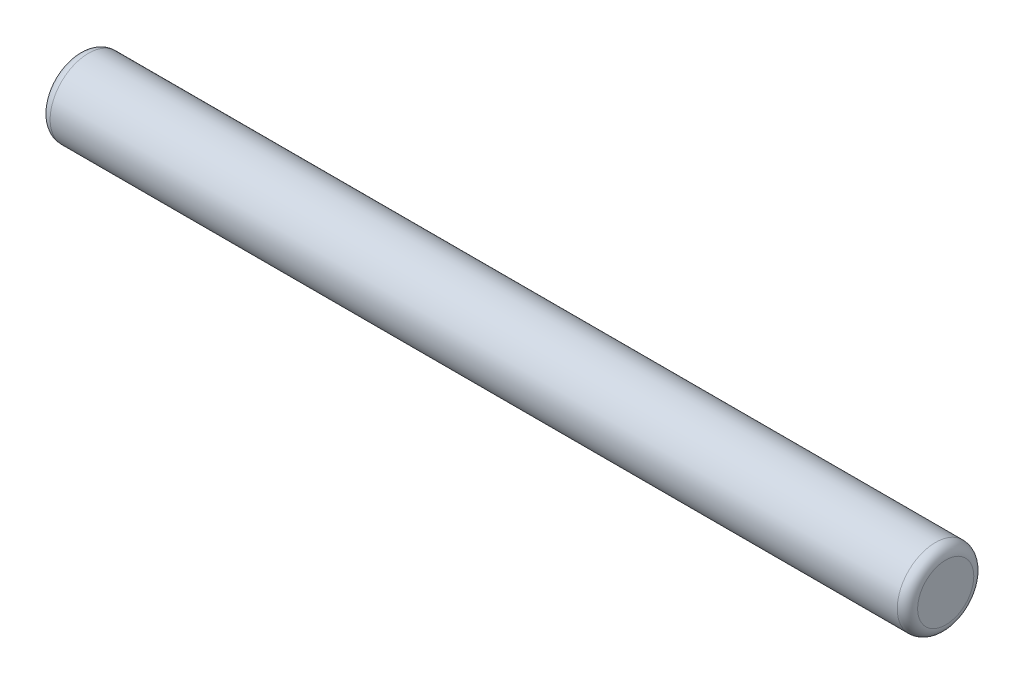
ISO-10303-21;
HEADER;
FILE_DESCRIPTION(('STEP AP214'),'2;1');
FILE_NAME('part.step','',(''),(''),'','','');
FILE_SCHEMA(('AUTOMOTIVE_DESIGN { 1 0 10303 214 1 1 1 1 }'));
ENDSEC;
DATA;
#1=APPLICATION_CONTEXT('core data for automotive mechanical design processes');
#2=APPLICATION_PROTOCOL_DEFINITION('international standard','automotive_design',2000,#1);
#3=PRODUCT_CONTEXT('',#1,'mechanical');
#4=PRODUCT('Part','Part','',(#3));
#5=PRODUCT_RELATED_PRODUCT_CATEGORY('part','',(#4));
#6=PRODUCT_DEFINITION_FORMATION('','',#4);
#7=PRODUCT_DEFINITION_CONTEXT('part definition',#1,'design');
#8=PRODUCT_DEFINITION('design','',#6,#7);
#9=PRODUCT_DEFINITION_SHAPE('','',#8);
#10=(LENGTH_UNIT() NAMED_UNIT(*) SI_UNIT(.MILLI.,.METRE.));
#11=(NAMED_UNIT(*) PLANE_ANGLE_UNIT() SI_UNIT($,.RADIAN.));
#12=(NAMED_UNIT(*) SI_UNIT($,.STERADIAN.) SOLID_ANGLE_UNIT());
#13=UNCERTAINTY_MEASURE_WITH_UNIT(LENGTH_MEASURE(1.E-05),#10,'distance_accuracy_value','');
#14=(GEOMETRIC_REPRESENTATION_CONTEXT(3) GLOBAL_UNCERTAINTY_ASSIGNED_CONTEXT((#13)) GLOBAL_UNIT_ASSIGNED_CONTEXT((#10,
#11,#12)) REPRESENTATION_CONTEXT('',''));
#15=CARTESIAN_POINT('',(0.,0.,0.));
#16=DIRECTION('',(0.,0.,1.));
#17=DIRECTION('',(1.,0.,0.));
#18=AXIS2_PLACEMENT_3D('',#15,#16,#17);
#19=CARTESIAN_POINT('',(107.95,0.,0.));
#20=DIRECTION('',(-1.,0.,0.));
#21=DIRECTION('',(0.,0.,1.));
#22=AXIS2_PLACEMENT_3D('',#19,#20,#21);
#23=CYLINDRICAL_SURFACE('',#22,4.7625);
#24=CARTESIAN_POINT('',(1.26999999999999,0.,0.));
#25=DIRECTION('',(1.,0.,0.));
#26=DIRECTION('',(0.,0.,-1.));
#27=AXIS2_PLACEMENT_3D('',#24,#25,#26);
#28=CIRCLE('',#27,4.7625);
#29=CARTESIAN_POINT('',(1.26999999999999,0.,-4.7625));
#30=VERTEX_POINT('',#29);
#31=EDGE_CURVE('E42',#30,#30,#28,.T.);
#32=ORIENTED_EDGE('',*,*,#31,.T.);
#33=EDGE_LOOP('',(#32));
#34=FACE_BOUND('',#33,.T.);
#35=CARTESIAN_POINT('',(106.68,0.,0.));
#36=DIRECTION('',(1.,0.,0.));
#37=DIRECTION('',(0.,0.,-1.));
#38=AXIS2_PLACEMENT_3D('',#35,#36,#37);
#39=CIRCLE('',#38,4.7625);
#40=CARTESIAN_POINT('',(106.68,0.,-4.7625));
#41=VERTEX_POINT('',#40);
#42=EDGE_CURVE('E46',#41,#41,#39,.F.);
#43=ORIENTED_EDGE('',*,*,#42,.T.);
#44=EDGE_LOOP('',(#43));
#45=FACE_BOUND('',#44,.T.);
#46=ADVANCED_FACE('F31',(#34,#45),#23,.T.);
#47=CARTESIAN_POINT('',(107.95,0.,0.));
#48=DIRECTION('',(1.,0.,0.));
#49=DIRECTION('',(0.,0.,-1.));
#50=AXIS2_PLACEMENT_3D('',#47,#48,#49);
#51=PLANE('',#50);
#52=CARTESIAN_POINT('',(107.95,0.,0.));
#53=DIRECTION('',(1.,0.,0.));
#54=DIRECTION('',(0.,0.,-1.));
#55=AXIS2_PLACEMENT_3D('',#52,#53,#54);
#56=CIRCLE('',#55,3.4925);
#57=CARTESIAN_POINT('',(107.95,0.,-3.4925));
#58=VERTEX_POINT('',#57);
#59=EDGE_CURVE('E10',#58,#58,#56,.T.);
#60=ORIENTED_EDGE('',*,*,#59,.T.);
#61=EDGE_LOOP('',(#60));
#62=FACE_BOUND('',#61,.T.);
#63=ADVANCED_FACE('F62',(#62),#51,.T.);
#64=CARTESIAN_POINT('',(0.,0.,0.));
#65=DIRECTION('',(1.,0.,0.));
#66=DIRECTION('',(0.,0.,-1.));
#67=AXIS2_PLACEMENT_3D('',#64,#65,#66);
#68=PLANE('',#67);
#69=CARTESIAN_POINT('',(0.,0.,0.));
#70=DIRECTION('',(1.,0.,0.));
#71=DIRECTION('',(0.,0.,-1.));
#72=AXIS2_PLACEMENT_3D('',#69,#70,#71);
#73=CIRCLE('',#72,3.4925);
#74=CARTESIAN_POINT('',(0.,0.,-3.4925));
#75=VERTEX_POINT('',#74);
#76=EDGE_CURVE('E38',#75,#75,#73,.F.);
#77=ORIENTED_EDGE('',*,*,#76,.T.);
#78=EDGE_LOOP('',(#77));
#79=FACE_BOUND('',#78,.T.);
#80=ADVANCED_FACE('F59',(#79),#68,.F.);
#81=CARTESIAN_POINT('',(1.26999999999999,0.,0.));
#82=DIRECTION('',(1.,0.,0.));
#83=DIRECTION('',(0.,0.,-1.));
#84=AXIS2_PLACEMENT_3D('',#81,#82,#83);
#85=TOROIDAL_SURFACE('',#84,3.4925,1.27);
#86=ORIENTED_EDGE('',*,*,#76,.F.);
#87=EDGE_LOOP('',(#86));
#88=FACE_BOUND('',#87,.T.);
#89=ORIENTED_EDGE('',*,*,#31,.F.);
#90=EDGE_LOOP('',(#89));
#91=FACE_BOUND('',#90,.T.);
#92=ADVANCED_FACE('F55',(#88,#91),#85,.T.);
#93=CARTESIAN_POINT('',(106.68,0.,0.));
#94=DIRECTION('',(1.,0.,0.));
#95=DIRECTION('',(0.,0.,-1.));
#96=AXIS2_PLACEMENT_3D('',#93,#94,#95);
#97=TOROIDAL_SURFACE('',#96,3.4925,1.27);
#98=ORIENTED_EDGE('',*,*,#42,.F.);
#99=EDGE_LOOP('',(#98));
#100=FACE_BOUND('',#99,.T.);
#101=ORIENTED_EDGE('',*,*,#59,.F.);
#102=EDGE_LOOP('',(#101));
#103=FACE_BOUND('',#102,.T.);
#104=ADVANCED_FACE('F33',(#100,#103),#97,.T.);
#105=CLOSED_SHELL('',(#46,#63,#80,#92,#104));
#106=MANIFOLD_SOLID_BREP('B2',#105);
#107=ADVANCED_BREP_SHAPE_REPRESENTATION('',(#18,#106),#14);
#108=SHAPE_DEFINITION_REPRESENTATION(#9,#107);
ENDSEC;
END-ISO-10303-21;
